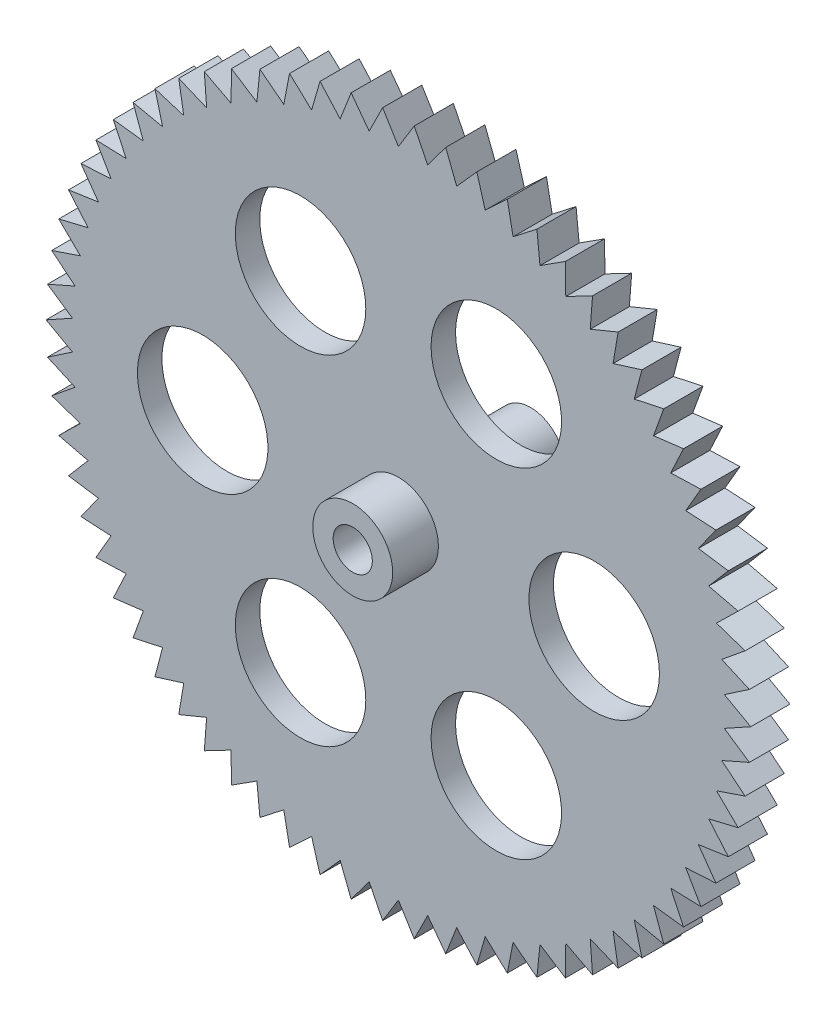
from build123d import *

# Parameters (mm, degrees)
ESQUISSE2_R                  = 2
EXTRUSION1_DEPTH             = 16.801344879
R_P_TITION_CIRCULAIRE1_COUNT = 6
EXTRUSION2_DEPTH             = 16.801344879
R_P_TITION_CIRCULAIRE2_COUNT = 70


with BuildPart() as part:
    # Esquisse1 → R_volution1 (revolve)
    with BuildSketch(Plane(origin=(0, 0, 0), x_dir=(0, 0, -1), z_dir=(1, 0, 0)), mode=Mode.PRIVATE) as r_volution1_sk:
        Polygon((0, 0.6), (0, 1.225), (1.4, 1.225), (1.4, 10.8), (2.6, 10.8), (2.6, 9), (2.15, 9), (2.15, 1.225), (2.95, 1.225), (2.95, 1.05), (5.45, 1.05), (5.45, 0.6), align=None)
    revolve(r_volution1_sk.sketch.rotate(Axis((0, 0, 0), (0, 0, -1)), 90), axis=Axis((0, 0, 0), (0, 0, -1)))

    # Esquisse2 → Extrusion1 (cut, through all)
    with BuildSketch(Plane.XY.offset(-1.4)):
        with Locations((6, 0)):
            Circle(ESQUISSE2_R)
    extrusion1 = extrude(amount=-EXTRUSION1_DEPTH, mode=Mode.SUBTRACT)

    # R_p_tition circulaire1: Extrusion1 ×6 about axis
    r_p_tition_circulaire1_axis = Axis((0, 0, 0), (0, 0, 1))
    for i in range(1, R_P_TITION_CIRCULAIRE1_COUNT):
        add(extrusion1.rotate(r_p_tition_circulaire1_axis, i * 360 / R_P_TITION_CIRCULAIRE1_COUNT), mode=Mode.SUBTRACT)

    # Esquisse3 → Extrusion2 (cut, through all)
    with BuildSketch(Plane.XY.offset(-1.4)):
        with BuildLine():
            Line((10.8, 0), (9.989930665, 0.448648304))
            Line((9.989930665, 0.448648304), (10.756522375, 0.968104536))
            ThreePointArc((10.756522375, 0.968104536), (10.789125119, 0.484540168), (10.8, 0))
        make_face()
    extrusion2 = extrude(amount=-EXTRUSION2_DEPTH, mode=Mode.SUBTRACT)

    # R_p_tition circulaire2: Extrusion2 ×70 about axis
    r_p_tition_circulaire2_axis = Axis((0, 0, 0), (0, 0, 1))
    for i in range(1, R_P_TITION_CIRCULAIRE2_COUNT):
        add(extrusion2.rotate(r_p_tition_circulaire2_axis, i * 360 / R_P_TITION_CIRCULAIRE2_COUNT), mode=Mode.SUBTRACT)


solid = part.part
